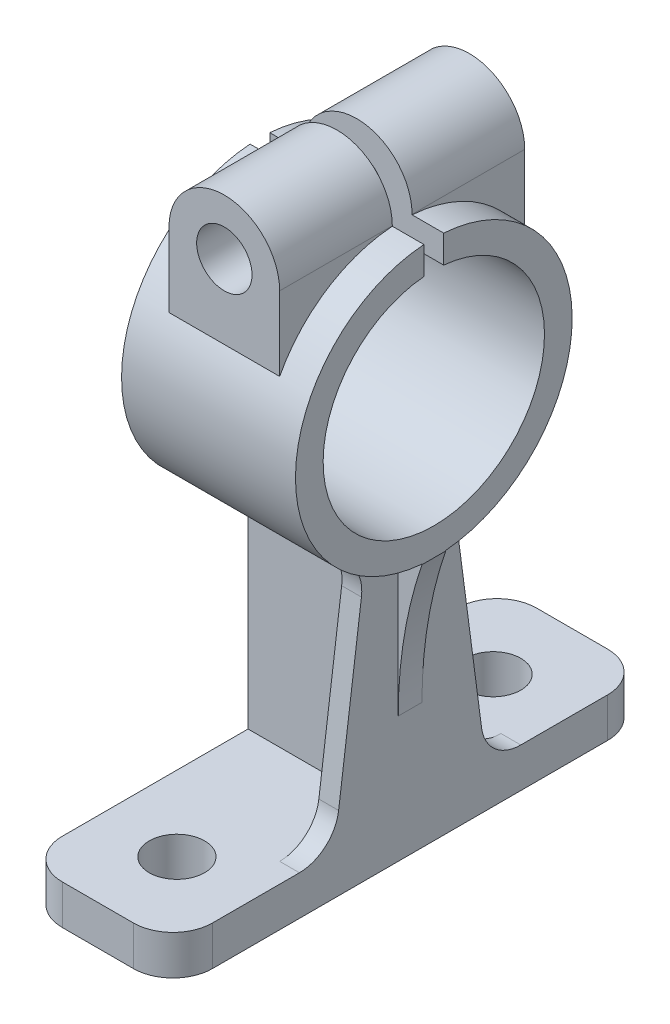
from build123d import *

# Parameters (mm, degrees)
SKETCH1_W                      = 38
SKETCH1_H                      = 120
EXTRUDE1_DEPTH                 = 10
EXTRUDE3_DEPTH                 = 6
EXTRUDE3_DEPTH_BACK            = 38
SKETCH2_R                      = 35
EXTRUDE4_DEPTH                 = 5
SKETCH6_W                      = 33
SKETCH6_H                      = 62.566305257
EXTRUDE8_DEPTH                 = 3
EXTRUDE9_DEPTH                 = 31
CUT_EXTRUDE1_REACH             = 171.234
F_14_0_14_DIAMETER_HOLE1_D     = 14
F_14_0_14_DIAMETER_HOLE2_D     = 14
F_14_0_14_DIAMETER_HOLE2_DEPTH = 10
FILLET1_R                      = 10


with BuildPart() as part:
    # Sketch1 → Extrude1 (new body)
    with BuildSketch(Plane(origin=(0, 0, 0), x_dir=(1, 0, 0), z_dir=(0, 1, 0))):
        with Locations((-19, 0)):
            Rectangle(SKETCH1_W, SKETCH1_H)
    extrude(amount=EXTRUDE1_DEPTH)



with BuildPart() as body_2:
    # Sketch2 → Extrude3 (new, two sides: drawn at the far end of the back side and taken through both)
    with BuildSketch(Plane(origin=(0, 0, 0), x_dir=(0, 0, -1), z_dir=(1, 0, 0)).offset(-EXTRUDE3_DEPTH_BACK)):
        with Locations((0, 103)):
            Circle(SKETCH2_R)
    extrude(amount=EXTRUDE3_DEPTH + EXTRUDE3_DEPTH_BACK)


with BuildPart() as part_1:
    add(part.part)

    add(body_2.part)  # Extrude4 merges body 2
    # Sketch5 → Extrude4 (add)
    with BuildSketch(Plane(origin=(0, 0, 0), x_dir=(0, 0, -1), z_dir=(1, 0, 0))):
        with BuildLine():
            Line((-12.309829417, 62.565701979), (-18.085551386, 18.694738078))
            ThreePointArc((-18.085551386, 18.694738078), (-21.406541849, 12.481601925), (-28, 10))
            Line((-28, 10), (28, 10))
            ThreePointArc((28, 10), (21.406541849, 12.481601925), (18.085551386, 18.694738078))
            Line((18.085551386, 18.694738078), (12.309829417, 62.565701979))
            ThreePointArc((12.309829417, 62.565701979), (13.271220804, 68.325485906), (17.28554958, 72.566305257))
            ThreePointArc((17.28554958, 72.566305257), (0, 68), (-17.28554958, 72.566305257))
            ThreePointArc((-17.28554958, 72.566305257), (-13.271220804, 68.325485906), (-12.309829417, 62.565701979))
        make_face()
    extrude(amount=-EXTRUDE4_DEPTH)

    # Sketch6 → Extrude8 (add, symmetric)
    with BuildSketch(Plane.XY):
        with Locations((-21.5, 41.283152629)):
            Rectangle(SKETCH6_W, SKETCH6_H)
        with BuildLine():
            Line((0, 72.566305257), (6, 72.566305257))
            Line((6, 72.566305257), (6, 68))
            ThreePointArc((6, 68), (1.510181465, 50.16402014), (0, 31.83371736))
            Line((0, 31.83371736), (0, 72.566305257))
        make_face()
    extrude(amount=EXTRUDE8_DEPTH, both=True)

    # Sketch7 → Extrude9 (add, symmetric)
    with BuildSketch(Plane.XY):
        with BuildLine():
            Line((-30, 118), (-30, 138))
            ThreePointArc((-30, 138), (-16, 152), (-2, 138))
            Line((-2, 138), (-2, 118))
            Line((-2, 118), (-30, 118))
        make_face()
    extrude(amount=EXTRUDE9_DEPTH, both=True)

    # Sketch8 → Cut-Extrude1 (cut, up to next)
    with BuildSketch(Plane(origin=(6, 0, 0), x_dir=(0, 0, -1), z_dir=(1, 0, 0)), mode=Mode.PRIVATE) as cut_extrude1_sk1:
        with BuildLine():
            Line((2.5, 130.888169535), (2.5, 152))
            Line((2.5, 152), (-2.5, 152))
            Line((-2.5, 152), (-2.5, 130.888169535))
            ThreePointArc((-2.5, 130.888169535), (0, 75), (2.5, 130.888169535))
        make_face()
    cut_extrude1_tool1 = extrude(cut_extrude1_sk1.sketch, amount=-CUT_EXTRUDE1_REACH, mode=Mode.PRIVATE) & part_1.part
    add(cut_extrude1_tool1.solids().sort_by_distance((6, 104.576091, 0))[0], mode=Mode.SUBTRACT)

    # 14.0 _14_ Diameter Hole1 (through all)
    with Locations(Plane.XY.offset(31)):
        with Locations((-16, 138)):
            Hole(F_14_0_14_DIAMETER_HOLE1_D / 2)

    # 14.0 _14_ Diameter Hole2
    with Locations(Plane(origin=(0, 10, 0), x_dir=(-1, 0, 0), z_dir=(0, 1, 0))):
        with Locations((19, 40), (19, -40)):
            Hole(F_14_0_14_DIAMETER_HOLE2_D / 2, depth=F_14_0_14_DIAMETER_HOLE2_DEPTH)

    # Fillet1
    fillet1_edges = [part_1.edges().sort_by_distance(p)[0] for p in [
        (-38, 5, -60),
        (0, 5, -60),
        (0, 5, 60),
        (-38, 5, 60),
    ]]
    fillet(fillet1_edges, radius=FILLET1_R)


solid = part_1.part
